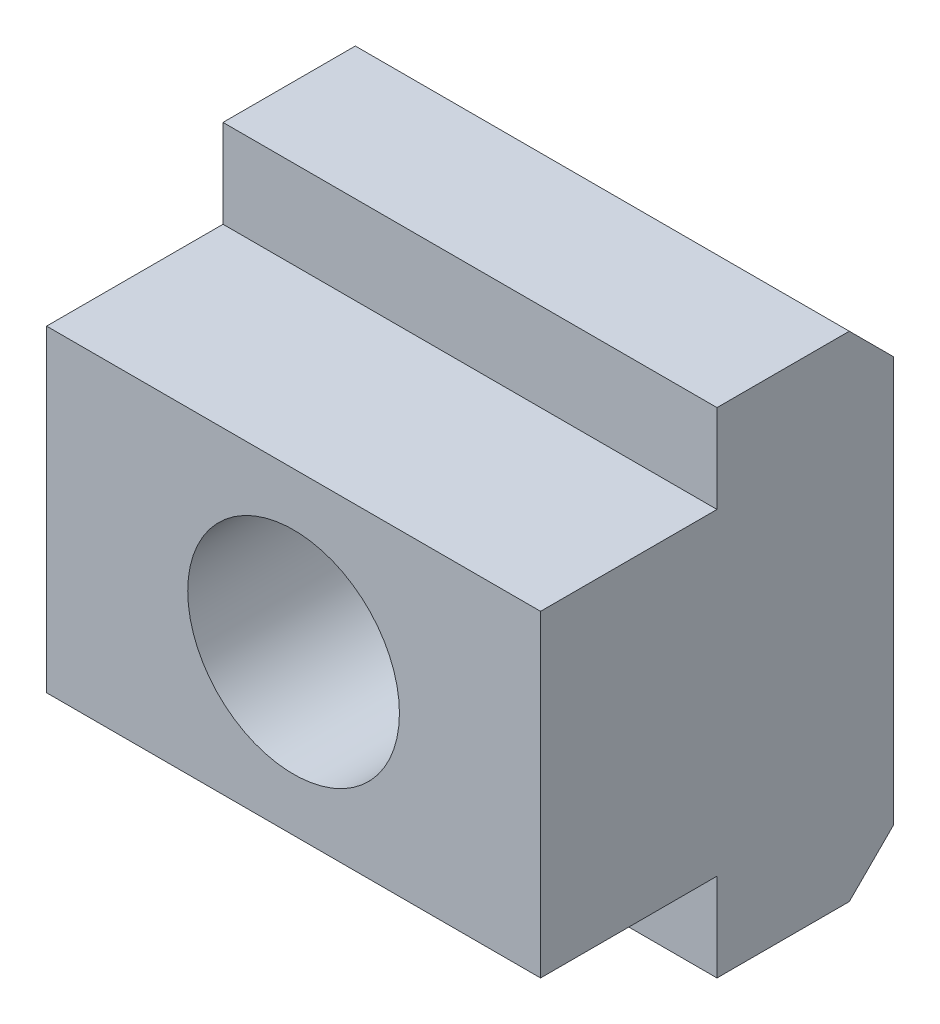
ISO-10303-21;
HEADER;
FILE_DESCRIPTION(('STEP AP214'),'2;1');
FILE_NAME('part.step','',(''),(''),'','','');
FILE_SCHEMA(('AUTOMOTIVE_DESIGN { 1 0 10303 214 1 1 1 1 }'));
ENDSEC;
DATA;
#1=APPLICATION_CONTEXT('core data for automotive mechanical design processes');
#2=APPLICATION_PROTOCOL_DEFINITION('international standard','automotive_design',2000,#1);
#3=PRODUCT_CONTEXT('',#1,'mechanical');
#4=PRODUCT('Part','Part','',(#3));
#5=PRODUCT_RELATED_PRODUCT_CATEGORY('part','',(#4));
#6=PRODUCT_DEFINITION_FORMATION('','',#4);
#7=PRODUCT_DEFINITION_CONTEXT('part definition',#1,'design');
#8=PRODUCT_DEFINITION('design','',#6,#7);
#9=PRODUCT_DEFINITION_SHAPE('','',#8);
#10=(LENGTH_UNIT() NAMED_UNIT(*) SI_UNIT(.MILLI.,.METRE.));
#11=(NAMED_UNIT(*) PLANE_ANGLE_UNIT() SI_UNIT($,.RADIAN.));
#12=(NAMED_UNIT(*) SI_UNIT($,.STERADIAN.) SOLID_ANGLE_UNIT());
#13=UNCERTAINTY_MEASURE_WITH_UNIT(LENGTH_MEASURE(1.E-05),#10,'distance_accuracy_value','');
#14=(GEOMETRIC_REPRESENTATION_CONTEXT(3) GLOBAL_UNCERTAINTY_ASSIGNED_CONTEXT((#13)) GLOBAL_UNIT_ASSIGNED_CONTEXT((#10,
#11,#12)) REPRESENTATION_CONTEXT('',''));
#15=CARTESIAN_POINT('',(0.,0.,0.));
#16=DIRECTION('',(0.,0.,1.));
#17=DIRECTION('',(1.,0.,0.));
#18=AXIS2_PLACEMENT_3D('',#15,#16,#17);
#19=CARTESIAN_POINT('',(-14.,-14.,-7.5));
#20=DIRECTION('',(0.,1.,0.));
#21=DIRECTION('',(0.,0.,1.));
#22=AXIS2_PLACEMENT_3D('',#19,#20,#21);
#23=PLANE('',#22);
#24=DIRECTION('',(0.,0.,1.));
#25=VECTOR('',#24,1.);
#26=CARTESIAN_POINT('',(14.,-14.,0.));
#27=LINE('',#26,#25);
#28=CARTESIAN_POINT('',(14.,-14.,-7.5));
#29=VERTEX_POINT('',#28);
#30=CARTESIAN_POINT('',(14.,-14.,0.));
#31=VERTEX_POINT('',#30);
#32=EDGE_CURVE('E123',#29,#31,#27,.T.);
#33=ORIENTED_EDGE('',*,*,#32,.T.);
#34=DIRECTION('',(-1.,0.,0.));
#35=VECTOR('',#34,1.);
#36=CARTESIAN_POINT('',(0.,-14.,0.));
#37=LINE('',#36,#35);
#38=CARTESIAN_POINT('',(-14.,-14.,0.));
#39=VERTEX_POINT('',#38);
#40=EDGE_CURVE('E87',#31,#39,#37,.T.);
#41=ORIENTED_EDGE('',*,*,#40,.T.);
#42=DIRECTION('',(0.,0.,1.));
#43=VECTOR('',#42,1.);
#44=CARTESIAN_POINT('',(-14.,-14.,0.));
#45=LINE('',#44,#43);
#46=CARTESIAN_POINT('',(-14.,-14.,-7.5));
#47=VERTEX_POINT('',#46);
#48=EDGE_CURVE('E106',#47,#39,#45,.T.);
#49=ORIENTED_EDGE('',*,*,#48,.F.);
#50=DIRECTION('',(1.,0.,0.));
#51=VECTOR('',#50,1.);
#52=CARTESIAN_POINT('',(0.,-14.,-7.5));
#53=LINE('',#52,#51);
#54=EDGE_CURVE('E86',#47,#29,#53,.T.);
#55=ORIENTED_EDGE('',*,*,#54,.T.);
#56=EDGE_LOOP('',(#33,#41,#49,#55));
#57=FACE_BOUND('',#56,.T.);
#58=ADVANCED_FACE('F14',(#57),#23,.F.);
#59=CARTESIAN_POINT('',(14.,9.,0.));
#60=DIRECTION('',(0.,0.,-1.));
#61=DIRECTION('',(-1.,0.,0.));
#62=AXIS2_PLACEMENT_3D('',#59,#60,#61);
#63=PLANE('',#62);
#64=DIRECTION('',(0.,1.,0.));
#65=VECTOR('',#64,1.);
#66=CARTESIAN_POINT('',(14.,0.,0.));
#67=LINE('',#66,#65);
#68=CARTESIAN_POINT('',(14.,9.,0.));
#69=VERTEX_POINT('',#68);
#70=CARTESIAN_POINT('',(14.,14.,0.));
#71=VERTEX_POINT('',#70);
#72=EDGE_CURVE('E128',#69,#71,#67,.T.);
#73=ORIENTED_EDGE('',*,*,#72,.T.);
#74=DIRECTION('',(-1.,0.,0.));
#75=VECTOR('',#74,1.);
#76=CARTESIAN_POINT('',(0.,14.,0.));
#77=LINE('',#76,#75);
#78=CARTESIAN_POINT('',(-14.,14.,0.));
#79=VERTEX_POINT('',#78);
#80=EDGE_CURVE('E219',#71,#79,#77,.T.);
#81=ORIENTED_EDGE('',*,*,#80,.T.);
#82=DIRECTION('',(0.,1.,0.));
#83=VECTOR('',#82,1.);
#84=CARTESIAN_POINT('',(-14.,0.,0.));
#85=LINE('',#84,#83);
#86=CARTESIAN_POINT('',(-14.,9.,0.));
#87=VERTEX_POINT('',#86);
#88=EDGE_CURVE('E97',#87,#79,#85,.T.);
#89=ORIENTED_EDGE('',*,*,#88,.F.);
#90=DIRECTION('',(1.,0.,0.));
#91=VECTOR('',#90,1.);
#92=CARTESIAN_POINT('',(0.,9.,0.));
#93=LINE('',#92,#91);
#94=EDGE_CURVE('E136',#87,#69,#93,.T.);
#95=ORIENTED_EDGE('',*,*,#94,.T.);
#96=EDGE_LOOP('',(#73,#81,#89,#95));
#97=FACE_BOUND('',#96,.T.);
#98=ADVANCED_FACE('F199',(#97),#63,.F.);
#99=CARTESIAN_POINT('',(-14.,14.,0.));
#100=DIRECTION('',(0.,-1.,0.));
#101=DIRECTION('',(0.,0.,-1.));
#102=AXIS2_PLACEMENT_3D('',#99,#100,#101);
#103=PLANE('',#102);
#104=DIRECTION('',(0.,0.,-1.));
#105=VECTOR('',#104,1.);
#106=CARTESIAN_POINT('',(14.,14.,0.));
#107=LINE('',#106,#105);
#108=CARTESIAN_POINT('',(14.,14.,-7.5));
#109=VERTEX_POINT('',#108);
#110=EDGE_CURVE('E81',#71,#109,#107,.T.);
#111=ORIENTED_EDGE('',*,*,#110,.T.);
#112=DIRECTION('',(-1.,0.,0.));
#113=VECTOR('',#112,1.);
#114=CARTESIAN_POINT('',(0.,14.,-7.5));
#115=LINE('',#114,#113);
#116=CARTESIAN_POINT('',(-14.,14.,-7.5));
#117=VERTEX_POINT('',#116);
#118=EDGE_CURVE('E74',#109,#117,#115,.T.);
#119=ORIENTED_EDGE('',*,*,#118,.T.);
#120=DIRECTION('',(0.,0.,-1.));
#121=VECTOR('',#120,1.);
#122=CARTESIAN_POINT('',(-14.,14.,0.));
#123=LINE('',#122,#121);
#124=EDGE_CURVE('E79',#79,#117,#123,.T.);
#125=ORIENTED_EDGE('',*,*,#124,.F.);
#126=ORIENTED_EDGE('',*,*,#80,.F.);
#127=EDGE_LOOP('',(#111,#119,#125,#126));
#128=FACE_BOUND('',#127,.T.);
#129=ADVANCED_FACE('F76',(#128),#103,.F.);
#130=CARTESIAN_POINT('',(14.,-14.,0.));
#131=DIRECTION('',(0.,0.,-1.));
#132=DIRECTION('',(-1.,0.,0.));
#133=AXIS2_PLACEMENT_3D('',#130,#131,#132);
#134=PLANE('',#133);
#135=DIRECTION('',(0.,1.,0.));
#136=VECTOR('',#135,1.);
#137=CARTESIAN_POINT('',(14.,0.,0.));
#138=LINE('',#137,#136);
#139=CARTESIAN_POINT('',(14.,-9.,0.));
#140=VERTEX_POINT('',#139);
#141=EDGE_CURVE('E125',#31,#140,#138,.T.);
#142=ORIENTED_EDGE('',*,*,#141,.T.);
#143=DIRECTION('',(-1.,0.,0.));
#144=VECTOR('',#143,1.);
#145=CARTESIAN_POINT('',(0.,-9.,0.));
#146=LINE('',#145,#144);
#147=CARTESIAN_POINT('',(-14.,-9.,0.));
#148=VERTEX_POINT('',#147);
#149=EDGE_CURVE('E156',#140,#148,#146,.T.);
#150=ORIENTED_EDGE('',*,*,#149,.T.);
#151=DIRECTION('',(0.,1.,0.));
#152=VECTOR('',#151,1.);
#153=CARTESIAN_POINT('',(-14.,0.,0.));
#154=LINE('',#153,#152);
#155=EDGE_CURVE('E118',#39,#148,#154,.T.);
#156=ORIENTED_EDGE('',*,*,#155,.F.);
#157=ORIENTED_EDGE('',*,*,#40,.F.);
#158=EDGE_LOOP('',(#142,#150,#156,#157));
#159=FACE_BOUND('',#158,.T.);
#160=ADVANCED_FACE('F190',(#159),#134,.F.);
#161=CARTESIAN_POINT('',(-14.,14.,-7.5));
#162=DIRECTION('',(0.,-0.707106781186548,0.707106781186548));
#163=DIRECTION('',(0.,-0.707106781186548,-0.707106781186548));
#164=AXIS2_PLACEMENT_3D('',#161,#162,#163);
#165=PLANE('',#164);
#166=DIRECTION('',(0.,-0.707106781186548,-0.707106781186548));
#167=VECTOR('',#166,1.);
#168=CARTESIAN_POINT('',(14.,14.,-7.5));
#169=LINE('',#168,#167);
#170=CARTESIAN_POINT('',(14.,11.5,-10.));
#171=VERTEX_POINT('',#170);
#172=EDGE_CURVE('E127',#109,#171,#169,.T.);
#173=ORIENTED_EDGE('',*,*,#172,.T.);
#174=DIRECTION('',(-1.,0.,0.));
#175=VECTOR('',#174,1.);
#176=CARTESIAN_POINT('',(0.,11.5,-10.));
#177=LINE('',#176,#175);
#178=CARTESIAN_POINT('',(-14.,11.5,-10.));
#179=VERTEX_POINT('',#178);
#180=EDGE_CURVE('E103',#171,#179,#177,.T.);
#181=ORIENTED_EDGE('',*,*,#180,.T.);
#182=DIRECTION('',(0.,-0.707106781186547,-0.707106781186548));
#183=VECTOR('',#182,1.);
#184=CARTESIAN_POINT('',(-14.,14.,-7.5));
#185=LINE('',#184,#183);
#186=EDGE_CURVE('E18',#117,#179,#185,.T.);
#187=ORIENTED_EDGE('',*,*,#186,.F.);
#188=ORIENTED_EDGE('',*,*,#118,.F.);
#189=EDGE_LOOP('',(#173,#181,#187,#188));
#190=FACE_BOUND('',#189,.T.);
#191=ADVANCED_FACE('F102',(#190),#165,.F.);
#192=CARTESIAN_POINT('',(-14.,-11.5,-10.));
#193=DIRECTION('',(0.,0.707106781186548,0.707106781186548));
#194=DIRECTION('',(0.,-0.707106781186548,0.707106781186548));
#195=AXIS2_PLACEMENT_3D('',#192,#193,#194);
#196=PLANE('',#195);
#197=DIRECTION('',(0.,-0.707106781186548,0.707106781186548));
#198=VECTOR('',#197,1.);
#199=CARTESIAN_POINT('',(14.,-11.5,-10.));
#200=LINE('',#199,#198);
#201=CARTESIAN_POINT('',(14.,-11.5,-10.));
#202=VERTEX_POINT('',#201);
#203=EDGE_CURVE('E126',#202,#29,#200,.T.);
#204=ORIENTED_EDGE('',*,*,#203,.T.);
#205=ORIENTED_EDGE('',*,*,#54,.F.);
#206=DIRECTION('',(0.,-0.707106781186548,0.707106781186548));
#207=VECTOR('',#206,1.);
#208=CARTESIAN_POINT('',(-14.,-11.5,-10.));
#209=LINE('',#208,#207);
#210=CARTESIAN_POINT('',(-14.,-11.5,-10.));
#211=VERTEX_POINT('',#210);
#212=EDGE_CURVE('E104',#211,#47,#209,.T.);
#213=ORIENTED_EDGE('',*,*,#212,.F.);
#214=DIRECTION('',(1.,0.,0.));
#215=VECTOR('',#214,1.);
#216=CARTESIAN_POINT('',(0.,-11.5,-10.));
#217=LINE('',#216,#215);
#218=EDGE_CURVE('E114',#211,#202,#217,.T.);
#219=ORIENTED_EDGE('',*,*,#218,.T.);
#220=EDGE_LOOP('',(#204,#205,#213,#219));
#221=FACE_BOUND('',#220,.T.);
#222=ADVANCED_FACE('F173',(#221),#196,.F.);
#223=CARTESIAN_POINT('',(-14.,-14.,-10.));
#224=DIRECTION('',(-1.,0.,0.));
#225=DIRECTION('',(0.,0.,1.));
#226=AXIS2_PLACEMENT_3D('',#223,#224,#225);
#227=PLANE('',#226);
#228=ORIENTED_EDGE('',*,*,#88,.T.);
#229=ORIENTED_EDGE('',*,*,#124,.T.);
#230=ORIENTED_EDGE('',*,*,#186,.T.);
#231=DIRECTION('',(0.,-1.,0.));
#232=VECTOR('',#231,1.);
#233=CARTESIAN_POINT('',(-14.,0.,-10.));
#234=LINE('',#233,#232);
#235=EDGE_CURVE('E171',#179,#211,#234,.T.);
#236=ORIENTED_EDGE('',*,*,#235,.T.);
#237=ORIENTED_EDGE('',*,*,#212,.T.);
#238=ORIENTED_EDGE('',*,*,#48,.T.);
#239=ORIENTED_EDGE('',*,*,#155,.T.);
#240=DIRECTION('',(0.,0.,1.));
#241=VECTOR('',#240,1.);
#242=CARTESIAN_POINT('',(-14.,-9.,5.));
#243=LINE('',#242,#241);
#244=CARTESIAN_POINT('',(-14.,-9.,10.));
#245=VERTEX_POINT('',#244);
#246=EDGE_CURVE('E134',#148,#245,#243,.T.);
#247=ORIENTED_EDGE('',*,*,#246,.T.);
#248=DIRECTION('',(0.,1.,0.));
#249=VECTOR('',#248,1.);
#250=CARTESIAN_POINT('',(-14.,0.,10.));
#251=LINE('',#250,#249);
#252=CARTESIAN_POINT('',(-14.,9.,10.));
#253=VERTEX_POINT('',#252);
#254=EDGE_CURVE('E122',#245,#253,#251,.T.);
#255=ORIENTED_EDGE('',*,*,#254,.T.);
#256=DIRECTION('',(0.,0.,-1.));
#257=VECTOR('',#256,1.);
#258=CARTESIAN_POINT('',(-14.,9.,5.));
#259=LINE('',#258,#257);
#260=EDGE_CURVE('E99',#253,#87,#259,.T.);
#261=ORIENTED_EDGE('',*,*,#260,.T.);
#262=EDGE_LOOP('',(#228,#229,#230,#236,#237,#238,#239,#247,#255,#261));
#263=FACE_BOUND('',#262,.T.);
#264=ADVANCED_FACE('F92',(#263),#227,.T.);
#265=CARTESIAN_POINT('',(-14.,9.,10.));
#266=DIRECTION('',(0.,-1.,0.));
#267=DIRECTION('',(0.,0.,-1.));
#268=AXIS2_PLACEMENT_3D('',#265,#266,#267);
#269=PLANE('',#268);
#270=DIRECTION('',(0.,0.,-1.));
#271=VECTOR('',#270,1.);
#272=CARTESIAN_POINT('',(14.,9.,0.));
#273=LINE('',#272,#271);
#274=CARTESIAN_POINT('',(14.,9.,10.));
#275=VERTEX_POINT('',#274);
#276=EDGE_CURVE('E151',#275,#69,#273,.T.);
#277=ORIENTED_EDGE('',*,*,#276,.T.);
#278=ORIENTED_EDGE('',*,*,#94,.F.);
#279=ORIENTED_EDGE('',*,*,#260,.F.);
#280=DIRECTION('',(1.,0.,0.));
#281=VECTOR('',#280,1.);
#282=CARTESIAN_POINT('',(0.,9.,10.));
#283=LINE('',#282,#281);
#284=EDGE_CURVE('E166',#253,#275,#283,.T.);
#285=ORIENTED_EDGE('',*,*,#284,.T.);
#286=EDGE_LOOP('',(#277,#278,#279,#285));
#287=FACE_BOUND('',#286,.T.);
#288=ADVANCED_FACE('F215',(#287),#269,.F.);
#289=CARTESIAN_POINT('',(14.,-14.,-10.));
#290=DIRECTION('',(-1.,0.,0.));
#291=DIRECTION('',(0.,0.,1.));
#292=AXIS2_PLACEMENT_3D('',#289,#290,#291);
#293=PLANE('',#292);
#294=ORIENTED_EDGE('',*,*,#110,.F.);
#295=ORIENTED_EDGE('',*,*,#72,.F.);
#296=ORIENTED_EDGE('',*,*,#276,.F.);
#297=DIRECTION('',(0.,-1.,0.));
#298=VECTOR('',#297,1.);
#299=CARTESIAN_POINT('',(14.,0.,10.));
#300=LINE('',#299,#298);
#301=CARTESIAN_POINT('',(14.,-9.,10.));
#302=VERTEX_POINT('',#301);
#303=EDGE_CURVE('E163',#275,#302,#300,.T.);
#304=ORIENTED_EDGE('',*,*,#303,.T.);
#305=DIRECTION('',(0.,0.,-1.));
#306=VECTOR('',#305,1.);
#307=CARTESIAN_POINT('',(14.,-9.,5.));
#308=LINE('',#307,#306);
#309=EDGE_CURVE('E33',#302,#140,#308,.T.);
#310=ORIENTED_EDGE('',*,*,#309,.T.);
#311=ORIENTED_EDGE('',*,*,#141,.F.);
#312=ORIENTED_EDGE('',*,*,#32,.F.);
#313=ORIENTED_EDGE('',*,*,#203,.F.);
#314=DIRECTION('',(0.,1.,0.));
#315=VECTOR('',#314,1.);
#316=CARTESIAN_POINT('',(14.,0.,-10.));
#317=LINE('',#316,#315);
#318=EDGE_CURVE('E119',#202,#171,#317,.T.);
#319=ORIENTED_EDGE('',*,*,#318,.T.);
#320=ORIENTED_EDGE('',*,*,#172,.F.);
#321=EDGE_LOOP('',(#294,#295,#296,#304,#310,#311,#312,#313,#319,#320));
#322=FACE_BOUND('',#321,.T.);
#323=ADVANCED_FACE('F178',(#322),#293,.F.);
#324=CARTESIAN_POINT('',(-14.,-9.,0.));
#325=DIRECTION('',(0.,1.,0.));
#326=DIRECTION('',(0.,0.,1.));
#327=AXIS2_PLACEMENT_3D('',#324,#325,#326);
#328=PLANE('',#327);
#329=ORIENTED_EDGE('',*,*,#309,.F.);
#330=DIRECTION('',(-1.,0.,0.));
#331=VECTOR('',#330,1.);
#332=CARTESIAN_POINT('',(0.,-9.,10.));
#333=LINE('',#332,#331);
#334=EDGE_CURVE('E132',#302,#245,#333,.T.);
#335=ORIENTED_EDGE('',*,*,#334,.T.);
#336=ORIENTED_EDGE('',*,*,#246,.F.);
#337=ORIENTED_EDGE('',*,*,#149,.F.);
#338=EDGE_LOOP('',(#329,#335,#336,#337));
#339=FACE_BOUND('',#338,.T.);
#340=ADVANCED_FACE('F189',(#339),#328,.F.);
#341=CARTESIAN_POINT('',(-14.,-11.5,-10.));
#342=DIRECTION('',(0.,0.,1.));
#343=DIRECTION('',(1.,0.,0.));
#344=AXIS2_PLACEMENT_3D('',#341,#342,#343);
#345=PLANE('',#344);
#346=CARTESIAN_POINT('',(0.,0.,-10.));
#347=DIRECTION('',(0.,0.,-1.));
#348=DIRECTION('',(-1.,0.,0.));
#349=AXIS2_PLACEMENT_3D('',#346,#347,#348);
#350=CIRCLE('',#349,6.);
#351=CARTESIAN_POINT('',(-6.,0.,-10.));
#352=VERTEX_POINT('',#351);
#353=EDGE_CURVE('E24',#352,#352,#350,.F.);
#354=ORIENTED_EDGE('',*,*,#353,.T.);
#355=EDGE_LOOP('',(#354));
#356=FACE_BOUND('',#355,.T.);
#357=ORIENTED_EDGE('',*,*,#218,.F.);
#358=ORIENTED_EDGE('',*,*,#235,.F.);
#359=ORIENTED_EDGE('',*,*,#180,.F.);
#360=ORIENTED_EDGE('',*,*,#318,.F.);
#361=EDGE_LOOP('',(#357,#358,#359,#360));
#362=FACE_BOUND('',#361,.T.);
#363=ADVANCED_FACE('F176',(#356,#362),#345,.F.);
#364=CARTESIAN_POINT('',(-14.,-9.,10.));
#365=DIRECTION('',(0.,0.,-1.));
#366=DIRECTION('',(0.,1.,0.));
#367=AXIS2_PLACEMENT_3D('',#364,#365,#366);
#368=PLANE('',#367);
#369=CARTESIAN_POINT('',(0.,0.,10.));
#370=DIRECTION('',(0.,0.,-1.));
#371=DIRECTION('',(-1.,0.,0.));
#372=AXIS2_PLACEMENT_3D('',#369,#370,#371);
#373=CIRCLE('',#372,6.);
#374=CARTESIAN_POINT('',(-6.,0.,10.));
#375=VERTEX_POINT('',#374);
#376=EDGE_CURVE('E9',#375,#375,#373,.T.);
#377=ORIENTED_EDGE('',*,*,#376,.T.);
#378=EDGE_LOOP('',(#377));
#379=FACE_BOUND('',#378,.T.);
#380=ORIENTED_EDGE('',*,*,#303,.F.);
#381=ORIENTED_EDGE('',*,*,#284,.F.);
#382=ORIENTED_EDGE('',*,*,#254,.F.);
#383=ORIENTED_EDGE('',*,*,#334,.F.);
#384=EDGE_LOOP('',(#380,#381,#382,#383));
#385=FACE_BOUND('',#384,.T.);
#386=ADVANCED_FACE('F202',(#379,#385),#368,.F.);
#387=CARTESIAN_POINT('',(0.,0.,10.));
#388=DIRECTION('',(0.,0.,-1.));
#389=DIRECTION('',(-1.,0.,0.));
#390=AXIS2_PLACEMENT_3D('',#387,#388,#389);
#391=CYLINDRICAL_SURFACE('',#390,6.);
#392=ORIENTED_EDGE('',*,*,#353,.F.);
#393=EDGE_LOOP('',(#392));
#394=FACE_BOUND('',#393,.T.);
#395=ORIENTED_EDGE('',*,*,#376,.F.);
#396=EDGE_LOOP('',(#395));
#397=FACE_BOUND('',#396,.T.);
#398=ADVANCED_FACE('F16',(#394,#397),#391,.F.);
#399=CLOSED_SHELL('',(#58,#98,#129,#160,#191,#222,#264,#288,#323,#340,#363,#386,#398));
#400=MANIFOLD_SOLID_BREP('B1',#399);
#401=ADVANCED_BREP_SHAPE_REPRESENTATION('',(#18,#400),#14);
#402=SHAPE_DEFINITION_REPRESENTATION(#9,#401);
ENDSEC;
END-ISO-10303-21;
